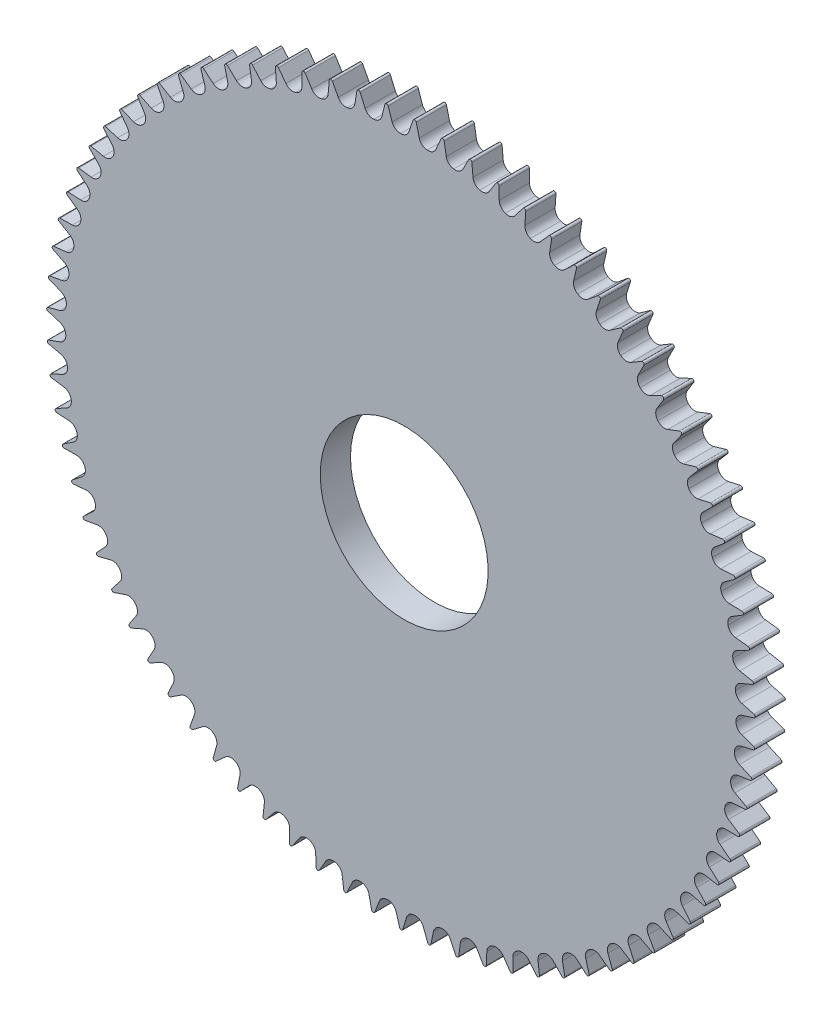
from build123d import *

# Parameters (mm, degrees)
EXTRUSION1_DEPTH        = 18
ESQUISSE3_R             = 50
ENL_V_MAT_EXTRU_1_DEPTH = 301.333560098


with BuildPart() as part:
    # Esquisse1 → Extrusion1 (new body)
    with BuildSketch(Plane.XY):
        with BuildLine():
            Line((-13.304746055, 202.974401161), (-11.494840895, 210.217871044))
            ThreePointArc((-11.494840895, 210.217871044), (-10.5654155, 210.974626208), (-9.577456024, 210.296064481))
            Line((-9.577456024, 210.296064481), (-7.183745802, 203.224023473))
            ThreePointArc((-7.183745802, 203.224023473), (-5.247582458, 200.665002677), (-2.163962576, 199.776968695))
            ThreePointArc((-2.163962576, 199.776968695), (0.918073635, 200.671016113), (2.849286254, 203.233960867))
            Line((2.849286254, 203.233960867), (5.228964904, 210.310735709))
            ThreePointArc((5.228964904, 210.310735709), (6.215576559, 210.991255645), (7.146501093, 210.236345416))
            Line((7.146501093, 210.236345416), (8.970769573, 202.996479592))
            ThreePointArc((8.970769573, 202.996479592), (10.697497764, 200.291719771), (13.700815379, 199.161498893))
            ThreePointArc((13.700815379, 199.161498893), (16.844140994, 199.807851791), (18.972875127, 202.2092595))
            Line((18.972875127, 202.2092595), (21.907282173, 209.074597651))
            ThreePointArc((21.907282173, 209.074597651), (22.944842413, 209.674579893), (23.812846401, 208.848093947))
            Line((23.812846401, 208.848093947), (25.056139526, 201.486176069))
            ThreePointArc((25.056139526, 201.486176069), (26.562515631, 198.652777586), (29.466543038, 197.287515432))
            ThreePointArc((29.466543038, 197.287515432), (32.651284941, 197.68208736), (34.964082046, 199.90677555))
            Line((34.964082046, 199.90677555), (38.434665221, 206.517272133))
            ThreePointArc((38.434665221, 206.517272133), (39.516614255, 207.0329234), (40.316209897, 206.140087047))
            Line((40.316209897, 206.140087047), (40.970667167, 198.70266153))
            ThreePointArc((40.970667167, 198.70266153), (42.247167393, 195.758538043), (45.033544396, 194.16686624))
            ThreePointArc((45.033544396, 194.16686624), (48.239567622, 194.307162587), (50.721805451, 196.341066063))
            Line((50.721805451, 196.341066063), (54.706622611, 202.654927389))
            ThreePointArc((54.706622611, 202.654927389), (55.82612001, 203.082987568), (56.552252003, 202.129445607))
            Line((56.552252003, 202.129445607), (56.61373573, 194.66353425))
            ThreePointArc((56.61373573, 194.66353425), (57.65228963, 191.627299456), (60.303399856, 189.819281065))
            ThreePointArc((60.303399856, 189.819281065), (63.510434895, 189.704414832), (66.146419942, 191.534674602))
            Line((66.146419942, 191.534674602), (70.62027779, 197.511982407))
            ThreePointArc((70.62027779, 197.511982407), (71.77024573, 197.849745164), (72.418323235, 196.841526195))
            Line((72.418323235, 196.841526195), (71.886444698, 189.394330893))
            ThreePointArc((71.886444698, 189.394330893), (72.680486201, 186.285180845), (75.179568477, 184.272246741))
            ThreePointArc((75.179568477, 184.272246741), (78.367339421, 183.90294415), (81.140406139, 185.517988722))
            Line((81.140406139, 185.517988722), (86.075019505, 191.120952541))
            ThreePointArc((86.075019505, 191.120952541), (87.248187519, 191.366282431), (87.814113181, 190.309760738))
            Line((87.814113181, 190.309760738), (86.692235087, 182.928365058))
            ThreePointArc((86.692235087, 182.928365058), (87.236744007, 179.765956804), (89.567998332, 177.560833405))
            ThreePointArc((89.567998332, 177.560833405), (92.716351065, 176.939429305), (95.608967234, 178.329047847))
            Line((95.608967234, 178.329047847), (100.973137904, 183.52224394))
            ThreePointArc((100.973137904, 183.52224394), (102.162088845, 183.673589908), (102.642284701, 182.575445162))
            Line((102.642284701, 182.575445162), (100.937499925, 175.306516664))
            ThreePointArc((100.937499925, 175.306516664), (101.2290337, 172.110843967), (103.377721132, 169.727472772))
            ThreePointArc((103.377721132, 169.727472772), (106.466750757, 168.85789588), (109.460628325, 170.013302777))
            Line((109.460628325, 170.013302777), (115.220442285, 174.763898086))
            ThreePointArc((115.220442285, 174.763898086), (116.417659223, 174.820303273), (116.809089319, 173.687478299))
            Line((116.809089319, 173.687478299), (114.532176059, 166.576973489))
            ThreePointArc((114.532176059, 166.576973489), (114.56889152, 163.368240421), (116.521427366, 160.821689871))
            ThreePointArc((116.521427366, 160.821689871), (119.531604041, 159.709437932), (122.607814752, 160.623328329))
            Line((122.607814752, 160.623328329), (128.726856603, 164.90128806))
            ThreePointArc((128.726856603, 164.90128806), (129.924770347, 164.862395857), (130.224959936, 163.702052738))
            Line((130.224959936, 163.702052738), (127.390313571, 156.794926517))
            ThreePointArc((127.390313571, 156.794926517), (127.17197859, 153.593419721), (128.91601829, 150.899789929))
            ThreePointArc((128.91601829, 150.899789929), (131.82831071, 149.551894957), (134.967405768, 150.218490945))
            Line((134.967405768, 150.218490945), (141.406988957, 153.99676846))
            ThreePointArc((141.406988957, 153.99676846), (142.598025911, 153.862824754), (142.805077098, 152.682299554))
            Line((142.805077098, 152.682299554), (139.430619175, 146.022220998))
            ThreePointArc((139.430619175, 146.022220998), (138.958614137, 142.848181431), (140.483131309, 140.024502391))
            ThreePointArc((140.483131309, 140.024502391), (143.279127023, 138.449486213), (146.461260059, 138.864573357))
            Line((146.461260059, 138.864573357), (153.180671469, 142.11928117))
            ThreePointArc((153.180671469, 142.11928117), (154.357301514, 141.891132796), (154.469905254, 140.697889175))
            Line((154.469905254, 140.697889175), (150.576970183, 134.326965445))
            ThreePointArc((150.576970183, 134.326965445), (149.854279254, 131.200460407), (151.149635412, 128.264584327))
            ThreePointArc((151.149635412, 128.264584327), (153.811657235, 126.472404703), (157.016709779, 126.633358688))
            Line((157.016709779, 126.633358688), (163.973467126, 129.343919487))
            ThreePointArc((163.973467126, 129.343919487), (165.128251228, 129.023008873), (165.145695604, 127.824590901))
            Line((165.145695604, 127.824590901), (160.758895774, 121.783101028))
            ThreePointArc((160.758895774, 121.783101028), (159.79008804, 118.723897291), (160.848093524, 115.694385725))
            ThreePointArc((160.848093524, 115.694385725), (163.359311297, 113.696373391), (166.567019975, 113.602176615))
            Line((166.567019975, 113.602176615), (173.7171404, 115.751453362))
            ThreePointArc((173.7171404, 115.751453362), (174.842777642, 115.339809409), (174.764952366, 114.14379387))
            Line((174.764952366, 114.14379387), (169.912022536, 108.469934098))
            ThreePointArc((169.912022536, 108.469934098), (168.703223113, 105.497372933), (169.51718887, 102.393379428))
            ThreePointArc((169.51718887, 102.393379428), (171.861725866, 100.202166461), (175.051810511, 99.853414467))
            Line((175.051810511, 99.853414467), (182.350088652, 101.427818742))
            ThreePointArc((182.350088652, 101.427818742), (183.439462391, 100.928043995), (183.266859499, 99.741992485))
            Line((183.266859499, 99.741992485), (177.978481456, 94.471634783))
            ThreePointArc((177.978481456, 94.471634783), (176.537332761, 91.604509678), (177.10211264, 88.445658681))
            ThreePointArc((177.10211264, 88.445658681), (179.265145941, 86.075098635), (182.41743781, 85.473996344))
            Line((182.41743781, 85.473996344), (189.817731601, 86.463574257))
            ThreePointArc((189.817731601, 86.463574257), (190.863954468, 85.878828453), (190.597665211, 84.710239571))
            Line((190.597665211, 84.710239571), (184.907273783, 79.876704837))
            ThreePointArc((184.907273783, 79.876704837), (183.242887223, 77.13314268), (183.554910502, 73.939405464))
            ThreePointArc((183.554910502, 73.939405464), (185.522764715, 71.404485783), (188.617334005, 70.554833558))
            Line((188.617334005, 70.554833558), (196.072856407, 70.953328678))
            ThreePointArc((196.072856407, 70.953328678), (197.069313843, 70.287308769), (196.711021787, 69.143570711))
            Line((196.711021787, 69.143570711), (190.654593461, 64.777418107))
            ThreePointArc((190.654593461, 64.777418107), (188.777491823, 62.174764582), (188.834785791, 58.966332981))
            ThreePointArc((188.834785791, 58.966332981), (190.595019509, 56.283080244), (193.612301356, 55.19024986))
            Line((193.612301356, 55.19024986), (201.075916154, 54.995142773))
            ThreePointArc((201.075916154, 54.995142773), (202.016308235, 54.25205955), (201.568278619, 53.140403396))
            Line((201.568278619, 53.140403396), (195.184104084, 49.269237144))
            ThreePointArc((195.184104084, 49.269237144), (193.106155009, 46.823947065), (192.908357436, 43.621105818))
            ThreePointArc((192.908357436, 43.621105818), (194.449841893, 40.806484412), (197.37076007, 39.477385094))
            Line((197.37076007, 39.477385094), (204.79527989, 38.68990933))
            ThreePointArc((204.79527989, 38.68990933), (205.673661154, 37.874460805), (205.138726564, 36.801914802))
            Line((205.138726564, 36.801914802), (198.467168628, 33.450209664))
            ThreePointArc((198.467168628, 33.450209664), (196.20150958, 31.17774294), (195.749871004, 28.000741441))
            ThreePointArc((195.749871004, 28.000741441), (197.06286044, 25.072546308), (199.868947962, 23.51558105))
            Line((199.868947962, 23.51558105), (207.207432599, 22.140715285))
            ThreePointArc((207.207432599, 22.140715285), (208.018249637, 21.258056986), (207.399792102, 20.231402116))
            Line((207.399792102, 20.231402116), (200.483030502, 17.420348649))
            ThreePointArc((200.483030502, 17.420348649), (198.043985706, 15.335072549), (197.341361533, 12.203996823))
            ThreePointArc((197.341361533, 12.203996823), (198.417554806, 9.180740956), (201.091070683, 7.405753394))
            Line((201.091070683, 7.405753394), (208.297123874, 5.452189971))
            ThreePointArc((208.297123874, 5.452189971), (209.03525044, 4.507902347), (208.337180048, 3.533629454))
            Line((208.337180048, 3.533629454), (201.218944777, 1.281000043))
            ThreePointArc((201.218944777, 1.281000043), (198.62193466, -0.603901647), (197.672767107, -3.669255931))
            ThreePointArc((197.672767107, -3.669255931), (198.505360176, -6.768458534), (201.029401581, -8.750246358))
            Line((201.029401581, -8.750246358), (208.057464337, -11.270156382))
            ThreePointArc((208.057464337, -11.270156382), (208.718233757, -12.270103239), (207.944963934, -13.18583449))
            Line((207.944963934, -13.18583449), (200.670258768, -14.865797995))
            ThreePointArc((200.670258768, -14.865797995), (197.931702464, -16.538408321), (196.741992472, -19.518661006))
            ThreePointArc((196.741992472, -19.518661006), (197.325721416, -22.674216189), (199.684330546, -24.850274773))
            Line((199.684330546, -24.850274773), (206.489969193, -27.920599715))
            ThreePointArc((206.489969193, -27.920599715), (207.069203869, -28.96988382), (206.225623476, -29.821283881))
            Line((206.225623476, -29.821283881), (198.840441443, -30.917960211))
            ThreePointArc((198.840441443, -30.917960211), (195.977652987, -32.36770439), (194.554922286, -35.244013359))
            ThreePointArc((194.554922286, -35.244013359), (194.886096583, -38.435970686), (197.064361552, -40.792542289))
            Line((197.064361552, -40.792542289), (203.60454865, -44.393870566))
            ThreePointArc((203.60454865, -44.393870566), (204.098586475, -45.485858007), (203.190028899, -46.267544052))
            Line((203.190028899, -46.267544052), (195.741061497, -46.773999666))
            ThreePointArc((195.741061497, -46.773999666), (192.772140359, -47.991711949), (191.125383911, -50.745892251))
            ThreePointArc((191.125383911, -50.745892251), (191.20190977, -53.95407114), (193.186058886, -56.476256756))
            Line((193.186058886, -56.476256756), (199.419445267, -60.585819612))
            ThreePointArc((199.419445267, -60.585819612), (199.825162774, -61.713606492), (198.857372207, -62.42063645))
            Line((198.857372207, -62.42063645), (191.391714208, -62.333669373))
            ThreePointArc((191.391714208, -62.333669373), (188.335430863, -63.311650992), (186.475059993, -65.926289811))
            ThreePointArc((186.475059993, -65.926289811), (186.296453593, -69.130407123), (188.073942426, -71.802260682))
            Line((188.073942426, -71.802260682), (193.961118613, -76.394076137))
            ThreePointArc((193.961118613, -76.394076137), (194.275950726, -77.550532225), (193.255045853, -78.178436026))
            Line((193.255045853, -78.178436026), (185.819897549, -77.498596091))
            ThreePointArc((185.819897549, -77.498596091), (182.695574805, -78.23066393), (180.633351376, -80.689230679))
            ThreePointArc((180.633351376, -80.689230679), (180.200741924, -83.869028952), (181.760332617, -86.673658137))
            Line((181.760332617, -86.673658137), (187.264077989, -91.718695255))
            ThreePointArc((187.264077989, -91.718695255), (187.486034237, -92.896509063), (186.418469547, -93.441316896))
            Line((186.418469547, -93.441316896), (179.060838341, -92.17290227))
            ThreePointArc((179.060838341, -92.17290227), (175.888229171, -92.654427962), (173.637191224, -94.94137879))
            ThreePointArc((173.637191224, -94.94137879), (172.953313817, -98.076754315), (174.285146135, -100.996427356))
            Line((174.285146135, -100.996427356), (179.37066424, -106.462789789))
            ThreePointArc((179.37066424, -106.462789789), (179.498341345, -107.654514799), (178.390866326, -108.112782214))
            Line((178.390866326, -108.112782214), (171.15726953, -106.263812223))
            ThreePointArc((171.15726953, -106.263812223), (167.956432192, -106.491751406), (165.530811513, -108.592627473))
            ThreePointArc((165.530811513, -108.592627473), (164.599989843, -111.663757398), (165.695643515, -114.680015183))
            Line((165.695643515, -114.680015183), (170.33078207, -120.533142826))
            ThreePointArc((170.33078207, -120.533142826), (170.363372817, -121.731244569), (169.222989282, -122.100074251))
            Line((169.222989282, -122.100074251), (162.159160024, -119.682238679))
            ThreePointArc((162.159160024, -119.682238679), (158.950331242, -119.655150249), (156.365463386, -121.556669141))
            ThreePointArc((156.365463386, -121.556669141), (155.193582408, -124.544136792), (156.046130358, -127.637909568))
            Line((156.046130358, -127.637909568), (160.201584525, -133.840797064))
            ThreePointArc((160.201584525, -133.840797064), (160.138882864, -135.037700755), (158.972800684, -135.314760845))
            Line((158.972800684, -135.314760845), (152.123398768, -132.343346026))
            ThreePointArc((152.123398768, -132.343346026), (148.926865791, -132.061401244), (146.199093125, -133.751540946))
            ThreePointArc((146.199093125, -133.751540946), (144.793561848, -136.636458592), (145.397613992, -139.788186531))
            Line((145.397613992, -139.788186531), (149.047111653, -146.301617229))
            ThreePointArc((149.047111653, -146.301617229), (148.889514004, -147.489755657), (147.705105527, -147.673294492))
            Line((147.705105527, -147.673294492), (141.113435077, -144.167086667))
            ThreePointArc((141.113435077, -144.167086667), (137.949407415, -143.63206808), (135.095975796, -145.100142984))
            ThreePointArc((135.095975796, -145.100142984), (133.465680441, -147.864271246), (133.817417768, -151.054028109))
            Line((133.817417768, -151.054028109), (136.937885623, -157.836822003))
            ThreePointArc((136.937885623, -157.836822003), (136.686388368, -159.008683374), (135.491141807, -159.097540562))
            Line((135.491141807, -159.097540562), (129.198877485, -155.078707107))
            ThreePointArc((129.198877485, -155.078707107), (126.08735914, -154.293997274), (123.126308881, -155.530725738))
            ThreePointArc((123.126308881, -155.530725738), (121.2815567, -158.156588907), (121.378755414, -161.364208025))
            Line((121.378755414, -161.364208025), (123.95046486, -168.373482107))
            ThreePointArc((123.95046486, -168.373482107), (123.606658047, -169.521657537), (122.408130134, -169.515271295))
            Line((122.408130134, -169.515271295), (116.455053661, -165.009220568))
            ThreePointArc((116.455053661, -165.009220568), (113.415716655, -163.979780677), (110.365768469, -164.977343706))
            ThreePointArc((110.365768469, -164.977343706), (108.31822258, -167.44834023), (108.160268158, -170.653542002))
            Line((108.160268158, -170.653542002), (110.16696002, -177.844981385))
            ThreePointArc((110.16696002, -177.844981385), (109.733017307, -178.962211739), (108.538785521, -178.860622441))
            Line((108.538785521, -178.860622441), (102.962534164, -173.895843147))
            ThreePointArc((102.962534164, -173.895843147), (100.014594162, -172.628181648), (96.895030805, -173.380272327))
            ThreePointArc((96.895030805, -173.380272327), (94.657636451, -175.680779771), (94.245527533, -178.863299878))
            Line((94.245527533, -178.863299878), (95.674514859, -186.191437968))
            ThreePointArc((95.674514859, -186.191437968), (95.15317977, -187.270659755), (93.97079443, -187.074509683))
            Line((93.97079443, -187.074509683), (88.806623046, -181.682390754))
            ThreePointArc((88.806623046, -181.682390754), (85.968717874, -180.184522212), (82.799262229, -180.686385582))
            ThreePointArc((82.799262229, -180.686385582), (80.386164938, -182.801859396), (79.722507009, -185.941576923))
            Line((79.722507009, -185.941576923), (80.564755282, -193.36008287))
            ThreePointArc((80.564755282, -193.36008287), (79.959323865, -194.394472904), (78.796260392, -194.105002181))
            Line((78.796260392, -194.105002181), (74.076818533, -188.319634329))
            ThreePointArc((74.076818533, -188.319634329), (71.366890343, -186.60102875), (68.167580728, -186.849491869))
            ThreePointArc((68.167580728, -186.849491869), (65.594036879, -188.766557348), (64.683025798, -191.843621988))
            Line((64.683025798, -191.843621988), (64.933210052, -199.30559361))
            ThreePointArc((64.933210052, -199.30559361), (64.247510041, -200.288612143), (63.111121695, -199.907650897))
            Line((63.111121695, -199.907650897), (58.866247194, -193.76561108))
            ThreePointArc((58.866247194, -193.76561108), (56.301429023, -191.837134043), (53.092492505, -191.830626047))
            ThreePointArc((53.092492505, -191.830626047), (50.37477287, -193.537162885), (49.222168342, -196.532120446))
            Line((49.222168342, -196.532120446), (48.878706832, -203.990380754))
            ThreePointArc((48.878706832, -203.990380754), (48.117073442, -204.915812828), (47.014544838, -204.445769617))
            Line((47.014544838, -204.445769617), (43.271075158, -197.98588979))
            ThreePointArc((43.271075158, -197.98588979), (40.867582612, -195.859733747), (37.669307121, -195.598295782))
            ThreePointArc((37.669307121, -195.598295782), (34.824593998, -197.083514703), (33.43768316, -199.977430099))
            Line((33.43768316, -199.977430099), (32.50274736, -207.384825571))
            ThreePointArc((32.50274736, -207.384825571), (31.669995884, -208.246820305), (30.608297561, -207.690666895))
            Line((30.608297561, -207.690666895), (27.389900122, -200.953788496))
            ThreePointArc((27.389900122, -200.953788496), (25.162928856, -198.643395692), (21.995534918, -198.128680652))
            ThreePointArc((21.995534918, -198.128680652), (19.0418135, -199.383191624), (17.429364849, -202.15776859))
            Line((17.429364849, -202.15776859), (15.908865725, -209.467467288))
            ThreePointArc((15.908865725, -209.467467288), (15.010261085, -210.260574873), (13.996105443, -209.621827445))
            Line((13.996105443, -209.621827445), (11.32312799, -202.650543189))
            ThreePointArc((11.32312799, -202.650543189), (9.286757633, -200.170520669), (6.170270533, -199.405782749))
            ThreePointArc((6.170270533, -199.405782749), (3.126215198, -200.42165435), (1.298423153, -203.059351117))
            Line((1.298423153, -203.059351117), (-0.798026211, -210.225138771))
            ThreePointArc((-0.798026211, -210.225138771), (-1.756802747, -210.944344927), (-2.71700389, -210.227041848))
            Line((-2.71700389, -210.227041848), (-4.827661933, -203.065426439))
            ThreePointArc((-4.827661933, -203.065426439), (-6.660556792, -200.431453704), (-9.706433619, -199.421527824))
            ThreePointArc((-9.706433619, -199.421527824), (-12.821577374, -200.192337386), (-14.853156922, -202.676477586))
            Line((-14.853156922, -202.676477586), (-17.512302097, -209.65304978))
            ThreePointArc((-17.512302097, -209.65304978), (-18.525188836, -210.293807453), (-19.425364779, -209.502483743))
            Line((-19.425364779, -209.502483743), (-20.960359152, -202.19581522))
            ThreePointArc((-20.960359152, -202.19581522), (-22.578190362, -199.424545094), (-25.534199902, -198.175816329))
            ThreePointArc((-25.534199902, -198.175816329), (-28.700737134, -198.696690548), (-30.923259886, -201.011568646))
            Line((-30.923259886, -201.011568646), (-34.128288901, -207.754817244))
            ThreePointArc((-34.128288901, -207.754817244), (-35.188882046, -208.313075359), (-36.023341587, -207.452734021))
            Line((-36.023341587, -207.452734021), (-36.972967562, -200.047207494))
            ThreePointArc((-36.972967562, -200.047207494), (-38.365506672, -197.156160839), (-41.212960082, -195.676524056))
            ThreePointArc((-41.212960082, -195.676524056), (-44.410870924, -195.944169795), (-46.810285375, -198.075150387))
            Line((-46.810285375, -198.075150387), (-50.540935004, -204.5424424))
            ThreePointArc((-50.540935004, -204.5424424), (-51.642529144, -205.014671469), (-52.405996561, -204.090751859))
            Line((-52.405996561, -204.090751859), (-52.764250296, -196.633187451))
            ThreePointArc((-52.764250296, -196.633187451), (-53.922693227, -193.640642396), (-56.643587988, -191.939452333))
            ThreePointArc((-56.643587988, -191.939452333), (-59.852654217, -191.952177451), (-62.413790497, -193.885787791))
            Line((-62.413790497, -193.885787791), (-66.646474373, -200.036234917))
            ThreePointArc((-66.646474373, -200.036234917), (-67.782104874, -200.419449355), (-68.46975328, -199.43779279))
            Line((-68.46975328, -199.43779279), (-68.23436978, -191.975339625))
            ThreePointArc((-68.23436978, -191.975339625), (-69.151392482, -188.900216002), (-71.728526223, -186.988228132))
            ThreePointArc((-71.728526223, -186.988228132), (-74.92845909, -186.745952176), (-77.63512487, -188.469967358))
            Line((-77.63512487, -188.469967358), (-82.343082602, -194.26468449))
            ThreePointArc((-82.343082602, -194.26468449), (-83.505569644, -194.556461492), (-84.113051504, -193.523274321))
            Line((-84.113051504, -193.523274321), (-83.285518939, -186.10311243))
            ThreePointArc((-83.285518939, -186.10311243), (-83.9553237, -182.964852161), (-86.37240295, -180.854154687))
            ThreePointArc((-86.37240295, -180.854154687), (-89.542971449, -180.358409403), (-92.378054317, -181.861929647))
            Line((-92.378054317, -181.861929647), (-97.53152068, -187.264280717))
            ThreePointArc((-97.53152068, -187.264280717), (-98.713514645, -187.462775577), (-99.236989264, -186.384589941))
            Line((-99.236989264, -186.384589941), (-97.822539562, -179.053631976))
            ThreePointArc((-97.822539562, -179.053631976), (-98.240891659, -175.872076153), (-100.482634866, -173.576013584))
            ThreePointArc((-100.482634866, -173.576013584), (-103.603793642, -172.829933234), (-106.549369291, -174.103452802))
            Line((-106.549369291, -174.103452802), (-112.115762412, -179.079282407))
            ThreePointArc((-112.115762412, -179.079282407), (-113.309790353, -179.183240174), (-113.745948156, -178.066872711))
            Line((-113.745948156, -178.066872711), (-111.753523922, -170.87146735))
            ThreePointArc((-111.753523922, -170.87146735), (-111.9177784, -167.666730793), (-113.970012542, -165.199819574))
            ThreePointArc((-113.970012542, -165.199819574), (-117.022028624, -164.208121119), (-120.059474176, -165.243588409))
            Line((-120.059474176, -165.243588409), (-126.003601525, -169.761437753))
            ThreePointArc((-126.003601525, -169.761437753), (-127.202114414, -169.770201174), (-127.548197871, -168.622709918))
            Line((-127.548197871, -168.622709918), (-124.990395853, -161.608348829))
            ThreePointArc((-124.990395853, -161.608348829), (-124.899514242, -158.400692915), (-126.749264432, -155.778529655))
            ThreePointArc((-126.749264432, -155.778529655), (-129.712841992, -154.54748293), (-132.82295374, -155.338351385))
            Line((-132.82295374, -155.338351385), (-139.10723463, -159.36965717))
            ThreePointArc((-139.10723463, -159.36965717), (-140.302655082, -159.283170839), (-140.556476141, -158.111810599))
            Line((-140.556476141, -158.111810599), (-137.449467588, -151.322840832))
            ThreePointArc((-137.449467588, -151.322840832), (-137.10402447, -148.132545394), (-138.739595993, -145.371708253))
            ThreePointArc((-138.739595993, -145.371708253), (-141.59599834, -143.909096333), (-144.759113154, -144.450365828))
            Line((-144.759113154, -144.450365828), (-151.343816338, -147.96964084))
            ThreePointArc((-151.343816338, -147.96964084), (-152.52858652, -147.788451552), (-152.688540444, -146.600628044))
            Line((-152.688540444, -146.600628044), (-149.051968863, -140.079971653))
            ThreePointArc((-149.051968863, -140.079971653), (-148.454148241, -136.927206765), (-149.865200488, -134.045150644))
            ThreePointArc((-149.865200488, -134.045150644), (-152.596368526, -132.360220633), (-155.792488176, -132.648469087))
            Line((-155.792488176, -132.648469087), (-162.635983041, -135.633463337))
            ThreePointArc((-162.635983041, -135.633463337), (-163.802612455, -135.358716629), (-163.867687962, -134.161939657))
            Line((-163.867687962, -134.161939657), (-159.724544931, -127.950822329))
            ThreePointArc((-159.724544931, -127.950822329), (-158.878126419, -124.855520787), (-160.055738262, -121.870466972))
            ThreePointArc((-160.055738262, -121.870466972), (-162.644404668, -119.973871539), (-165.853322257, -120.007276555))
            Line((-165.853322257, -120.007276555), (-172.912342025, -122.439117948))
            ThreePointArc((-172.912342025, -122.439117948), (-174.053454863, -122.072550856), (-174.023240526, -120.874386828))
            Line((-174.023240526, -120.874386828), (-169.399720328, -115.012077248))
            ThreePointArc((-169.399720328, -115.012077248), (-168.310055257, -111.993808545), (-169.246781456, -108.924629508))
            ThreePointArc((-169.246781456, -108.924629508), (-171.676579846, -106.82835954), (-174.878007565, -106.606709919))
            Line((-174.878007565, -106.606709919), (-182.107922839, -108.47002357))
            ThreePointArc((-182.107922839, -108.47002357), (-183.216304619, -108.01395365), (-183.090991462, -106.821977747))
            Line((-183.090991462, -106.821977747), (-178.016325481, -101.345539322))
            ThreePointArc((-178.016325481, -101.345539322), (-176.690303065, -98.423385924), (-177.380221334, -95.289486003))
            ThreePointArc((-177.380221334, -95.289486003), (-179.635789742, -93.006794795), (-182.809487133, -92.531491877))
            Line((-182.809487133, -92.531491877), (-190.164588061, -93.814497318))
            ThreePointArc((-190.164588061, -93.814497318), (-191.233231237, -93.271807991), (-191.013611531, -92.093556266))
            Line((-191.013611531, -92.093556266), (-185.519883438, -87.037612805))
            ThreePointArc((-185.519883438, -87.037612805), (-183.965887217, -84.230049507), (-184.404635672, -81.051242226))
            ThreePointArc((-184.404635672, -81.051242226), (-186.471713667, -78.596561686), (-189.597615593, -77.870610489))
            Line((-189.597615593, -77.870610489), (-197.03140086, -78.565196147))
            ThreePointArc((-197.03140086, -78.565196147), (-198.053549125, -77.939318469), (-197.741011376, -76.78224021))
            Line((-197.741011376, -76.78224021), (-191.86295429, -72.178757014))
            ThreePointArc((-191.86295429, -72.178757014), (-190.090809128, -69.503534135), (-190.275613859, -66.299916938))
            ThreePointArc((-190.275613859, -66.299916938), (-192.141132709, -63.688766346), (-195.199476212, -62.716756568))
            Line((-195.199476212, -62.716756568), (-202.664947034, -62.818531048))
            ThreePointArc((-202.664947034, -62.818531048), (-203.634138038, -62.11342202), (-203.230658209, -60.984832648))
            Line((-203.230658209, -60.984832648), (-197.0054351, -56.862914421))
            ThreePointArc((-197.0054351, -56.862914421), (-195.02634507, -54.33694558), (-194.956037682, -51.128772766))
            ThreePointArc((-194.956037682, -51.128772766), (-196.608202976, -48.377660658), (-199.579652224, -47.165737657))
            Line((-199.579652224, -47.165737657), (-207.02960949, -46.674057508))
            ThreePointArc((-207.02960949, -46.674057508), (-207.939715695, -45.894175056), (-207.447844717, -44.801209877))
            Line((-207.447844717, -44.801209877), (-200.914813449, -41.186916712))
            ThreePointArc((-200.914813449, -41.186916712), (-198.741290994, -38.826171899), (-198.416315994, -35.63372657))
            ThreePointArc((-198.416315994, -35.63372657), (-199.844682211, -32.760046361), (-202.710450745, -31.315872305))
            Line((-202.710450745, -31.315872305), (-210.097793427, -30.233846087))
            ThreePointArc((-210.097793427, -30.233846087), (-210.943060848, -29.38412088), (-210.365908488, -28.33368997))
            Line((-210.365908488, -28.33368997), (-203.566372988, -25.249872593))
            ThreePointArc((-203.566372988, -25.249872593), (-201.212159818, -23.069277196), (-200.634571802, -19.912743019))
            ThreePointArc((-200.634571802, -19.912743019), (-201.830108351, -16.934663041), (-204.572077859, -15.267368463))
            Line((-204.572077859, -15.267368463), (-211.850100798, -13.601837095))
            ThreePointArc((-211.850100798, -13.601837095), (-212.625185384, -12.687641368), (-211.966400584, -11.686385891))
            Line((-211.966400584, -11.686385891), (-204.943349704, -9.152541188))
            ThreePointArc((-204.943349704, -9.152541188), (-202.423329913, -7.165881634), (-201.596780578, -4.065215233))
            ThreePointArc((-201.596780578, -4.065215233), (-202.551928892, -1.001563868), (-205.15276376, 0.878310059))
            Line((-205.15276376, 0.878310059), (-212.275452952, 3.116816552))
            ThreePointArc((-212.275452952, 3.116816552), (-212.975454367, 4.089702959), (-212.239202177, 5.035452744))
            Line((-212.239202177, 5.035452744), (-205.037037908, 7.003304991))
            ThreePointArc((-205.037037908, 7.003304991), (-202.367143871, 8.783468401), (-201.296858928, 11.808663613))
            ThreePointArc((-201.296858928, 11.808663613), (-202.005580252, 14.938516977), (-204.448837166, 17.019085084))
            Line((-204.448837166, 17.019085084), (-211.371160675, 19.816414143))
            ThreePointArc((-211.371160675, 19.816414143), (-211.991653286, 20.841840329), (-211.18258853, 21.726105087))
            Line((-211.18258853, 21.726105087), (-203.846845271, 23.115523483))
            ThreePointArc((-203.846845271, 23.115523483), (-201.043956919, 24.677935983), (-199.736703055, 27.608533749))
            ThreePointArc((-199.736703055, 27.608533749), (-200.194516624, 30.784801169), (-202.464748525, 33.052909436))
            Line((-202.464748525, 33.052909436), (-209.142941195, 36.391375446))
            ThreePointArc((-209.142941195, 36.391375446), (-209.680002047, 37.462858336), (-208.803239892, 38.280047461))
            Line((-208.803239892, 38.280047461), (-201.380296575, 39.082247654))
            ThreePointArc((-201.380296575, 39.082247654), (-198.462134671, 40.41703117), (-196.926176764, 43.234503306))
            ThreePointArc((-196.926176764, 43.234503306), (-197.130188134, 46.437103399), (-199.213041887, 48.878412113))
            Line((-199.213041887, 48.878412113), (-205.604882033, 52.736908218))
            ThreePointArc((-205.604882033, 52.736908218), (-206.055115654, 53.847673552), (-205.116199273, 54.592620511))
            Line((-205.116199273, 54.592620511), (-197.652986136, 54.802530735))
            ThreePointArc((-197.652986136, 54.802530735), (-194.638000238, 55.901246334), (-192.88304911, 58.587779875))
            ThreePointArc((-192.88304911, 58.587779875), (-192.831968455, 61.796464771), (-194.714275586, 64.395539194))
            Line((-194.714275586, 64.395539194), (-200.779351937, 68.749670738))
            ThreePointArc((-200.779351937, 68.749670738), (-201.139911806, 69.8926959), (-200.144777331, 70.560690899))
            Line((-200.144777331, 70.560690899), (-192.688479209, 70.176984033))
            ThreePointArc((-192.688479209, 70.176984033), (-189.595731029, 71.032685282), (-187.632882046, 73.571295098))
            ThreePointArc((-187.632882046, 73.571295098), (-187.327032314, 76.765778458), (-188.996892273, 79.506186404))
            Line((-188.996892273, 79.506186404), (-194.696859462, 84.328425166))
            ThreePointArc((-194.696859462, 84.328425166), (-194.965466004, 85.496483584), (-193.920404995, 86.083303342))
            Line((-193.920404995, 86.083303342), (-186.518163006, 85.108405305))
            ThreePointArc((-186.518163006, 85.108405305), (-183.367205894, 85.715682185), (-181.208868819, 88.090318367))
            ThreePointArc((-181.208868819, 88.090318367), (-180.650183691, 91.250403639), (-182.097039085, 94.114819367))
            Line((-182.097039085, 94.114819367), (-187.395860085, 99.3746776))
            ThreePointArc((-187.395860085, 99.3746776), (-187.570815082, 100.560384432), (-186.482434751, 101.062318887))
            Line((-186.482434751, 101.062318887), (-179.181048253, 99.502393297))
            ThreePointArc((-179.181048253, 99.502393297), (-175.991803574, 99.857406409), (-173.651624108, 102.053055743))
            ThreePointArc((-173.651624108, 102.053055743), (-172.843635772, 105.15876385), (-174.058339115, 108.129077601))
            Line((-174.058339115, 108.129077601), (-178.922513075, 113.793300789))
            ThreePointArc((-178.922513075, 113.793300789), (-179.002710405, 114.989159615), (-177.877891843, 115.403035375))
            Line((-177.877891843, 115.403035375), (-170.723522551, 113.267944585))
            ThreePointArc((-170.723522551, 113.267944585), (-167.516153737, 113.368449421), (-165.008927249, 115.371230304))
            ThreePointArc((-165.008927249, 115.371230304), (-163.956744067, 118.402925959), (-164.931615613, 121.460358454))
            Line((-164.931615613, 121.460358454), (-169.330389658, 127.493135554))
            ThreePointArc((-169.330389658, 127.493135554), (-169.315322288, 128.691585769), (-168.16117696, 129.014786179))
            Line((-168.16117696, 129.014786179), (-161.199057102, 126.318028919))
            ThreePointArc((-161.199057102, 126.318028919), (-157.993842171, 126.163390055), (-155.335420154, 127.960640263))
            ThreePointArc((-155.335420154, 127.960640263), (-154.045694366, 130.89915611), (-154.774570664, 134.024377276))
            Line((-154.774570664, 134.024377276), (-158.680134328, 140.387567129))
            ThreePointArc((-158.680134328, 140.387567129), (-158.569897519, 141.581031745), (-157.393722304, 141.811513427))
            Line((-157.393722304, 141.811513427), (-150.667868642, 138.570139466))
            ThreePointArc((-150.667868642, 138.570139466), (-147.485071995, 138.161334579), (-144.692261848, 139.741691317))
            ThreePointArc((-144.692261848, 139.741691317), (-143.173147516, 142.568449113), (-143.651420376, 145.741700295))
            Line((-143.651420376, 145.741700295), (-147.039081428, 152.395072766))
            ThreePointArc((-147.039081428, 152.395072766), (-146.834372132, 153.576006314), (-145.643603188, 153.71231209))
            Line((-145.643603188, 153.71231209), (-139.196538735, 149.946814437))
            ThreePointArc((-139.196538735, 149.946814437), (-136.056283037, 149.286428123), (-133.146741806, 150.639899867))
            ThreePointArc((-133.146741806, 150.639899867), (-131.40784326, 153.337027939), (-131.632488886, 156.538246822))
            Line((-131.632488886, 156.538246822), (-134.480829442, 163.439737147))
            ThreePointArc((-134.480829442, 163.439737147), (-134.182941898, 164.600673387), (-132.98510765, 164.641941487))
            Line((-132.98510765, 164.641941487), (-126.857592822, 160.376126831))
            ThreePointArc((-126.857592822, 160.376126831), (-123.779731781, 159.468334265), (-120.771854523, 160.58636393))
            ThreePointArc((-120.771854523, 160.58636393), (-118.824165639, 163.136810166), (-118.793763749, 166.345757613))
            Line((-118.793763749, 166.345757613), (-121.084775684, 173.45173235))
            ThreePointArc((-121.084775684, 173.45173235), (-120.695593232, 174.585331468), (-119.498266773, 174.531300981))
            Line((-119.498266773, 174.531300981), (-113.729041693, 169.792139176))
            ThreePointArc((-113.729041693, 169.792139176), (-110.733034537, 168.642679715), (-107.645838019, 169.518198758))
            ThreePointArc((-107.645838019, 169.518198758), (-105.501672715, 171.905838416), (-105.21641552, 175.102226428))
            Line((-105.21641552, 175.102226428), (-106.935614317, 182.367759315))
            ThreePointArc((-106.935614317, 182.367759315), (-106.457597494, 183.466854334), (-105.268348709, 183.317866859))
            Line((-105.268348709, 183.317866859), (-99.893888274, 178.135320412))
            ThreePointArc((-99.893888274, 178.135320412), (-96.998676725, 176.751461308), (-93.851679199, 177.378934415))
            ThreePointArc((-93.851679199, 177.378934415), (-91.524593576, 179.588672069), (-90.986284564, 182.752292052))
            Line((-90.986284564, 182.752292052), (-92.122800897, 190.131448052))
            ThreePointArc((-92.122800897, 190.131448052), (-91.558971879, 191.189090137), (-90.38531958, 190.946087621))
            Line((-90.38531958, 190.946087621), (-85.439602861, 185.352922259))
            ThreePointArc((-85.439602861, 185.352922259), (-82.663491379, 183.743412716), (-79.476589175, 184.1188728))
            ThreePointArc((-79.476589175, 184.1188728), (-76.981295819, 186.136737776), (-76.193338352, 189.247588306))
            Line((-76.193338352, 189.247588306), (-76.739986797, 196.693714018))
            ThreePointArc((-76.739986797, 196.693714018), (-76.093910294, 197.703216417), (-74.943274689, 197.3677352))
            Line((-74.943274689, 197.3677352), (-70.457570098, 191.399312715))
            ThreePointArc((-70.457570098, 191.399312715), (-67.818110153, 189.57432857), (-64.611451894, 189.695401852))
            ThreePointArc((-64.611451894, 189.695401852), (-61.963726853, 191.508636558), (-60.931102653, 194.547049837))
            Line((-60.931102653, 194.547049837), (-60.884427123, 202.013068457))
            ThreePointArc((-60.884427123, 202.013068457), (-60.160187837, 202.96804877), (-59.039843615, 202.542209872))
            Line((-59.039843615, 202.542209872), (-55.042511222, 196.236264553))
            ThreePointArc((-55.042511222, 196.236264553), (-52.55639033, 194.207343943), (-49.350249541, 194.073264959))
            ThreePointArc((-49.350249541, 194.073264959), (-46.566832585, 195.670405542), (-45.296070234, 198.617171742))
            Line((-45.296070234, 198.617171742), (-44.656365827, 206.055880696))
            ThreePointArc((-44.656365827, 206.055880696), (-43.858542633, 206.950301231), (-42.775572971, 206.436796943))
            Line((-42.775572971, 206.436796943), (-39.291885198, 199.833197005))
            ThreePointArc((-39.291885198, 199.833197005), (-36.974821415, 197.61316742), (-33.789468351, 197.224783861))
            ThreePointArc((-33.789468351, 197.224783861), (-30.887957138, 198.595732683), (-29.387090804, 201.4322214))
            Line((-29.387090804, 201.4322214), (-28.158401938, 208.796590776))
            ThreePointArc((-28.158401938, 208.796590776), (-27.29203893, 209.624796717), (-26.253290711, 209.026873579))
            Line((-26.253290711, 209.026873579), (-23.305272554, 202.167369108))
            ThreePointArc((-23.305272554, 202.167369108), (-21.171915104, 199.77026629), (-18.027488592, 199.13003364))
            ThreePointArc((-18.027488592, 199.13003364), (-15.026227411, 200.266123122), (-13.304746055, 202.974401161))
        make_face()
    extrude(amount=EXTRUSION1_DEPTH)

    # Esquisse3 → Enl_v. mat.-Extru.1 (cut, through all)
    with BuildSketch(Plane(origin=(0, 0, 0), x_dir=(-1, 0, 0), z_dir=(0, 0, -1))):
        Circle(ESQUISSE3_R)
    extrude(amount=-ENL_V_MAT_EXTRU_1_DEPTH, mode=Mode.SUBTRACT)


solid = part.part
